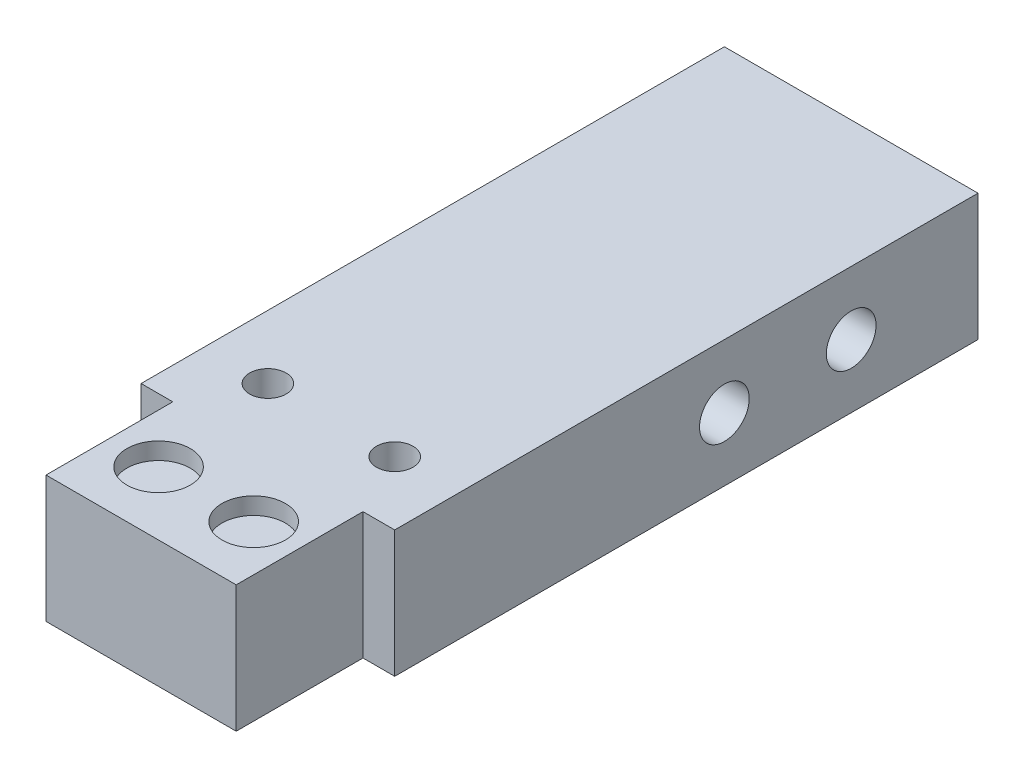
ISO-10303-21;
HEADER;
FILE_DESCRIPTION(('STEP AP214'),'2;1');
FILE_NAME('part.step','',(''),(''),'','','');
FILE_SCHEMA(('AUTOMOTIVE_DESIGN { 1 0 10303 214 1 1 1 1 }'));
ENDSEC;
DATA;
#1=APPLICATION_CONTEXT('core data for automotive mechanical design processes');
#2=APPLICATION_PROTOCOL_DEFINITION('international standard','automotive_design',2000,#1);
#3=PRODUCT_CONTEXT('',#1,'mechanical');
#4=PRODUCT('Part','Part','',(#3));
#5=PRODUCT_RELATED_PRODUCT_CATEGORY('part','',(#4));
#6=PRODUCT_DEFINITION_FORMATION('','',#4);
#7=PRODUCT_DEFINITION_CONTEXT('part definition',#1,'design');
#8=PRODUCT_DEFINITION('design','',#6,#7);
#9=PRODUCT_DEFINITION_SHAPE('','',#8);
#10=(LENGTH_UNIT() NAMED_UNIT(*) SI_UNIT(.MILLI.,.METRE.));
#11=(NAMED_UNIT(*) PLANE_ANGLE_UNIT() SI_UNIT($,.RADIAN.));
#12=(NAMED_UNIT(*) SI_UNIT($,.STERADIAN.) SOLID_ANGLE_UNIT());
#13=UNCERTAINTY_MEASURE_WITH_UNIT(LENGTH_MEASURE(1.E-05),#10,'distance_accuracy_value','');
#14=(GEOMETRIC_REPRESENTATION_CONTEXT(3) GLOBAL_UNCERTAINTY_ASSIGNED_CONTEXT((#13)) GLOBAL_UNIT_ASSIGNED_CONTEXT((#10,
#11,#12)) REPRESENTATION_CONTEXT('',''));
#15=CARTESIAN_POINT('',(0.,0.,0.));
#16=DIRECTION('',(0.,0.,1.));
#17=DIRECTION('',(1.,0.,0.));
#18=AXIS2_PLACEMENT_3D('',#15,#16,#17);
#19=CARTESIAN_POINT('',(12.7,22.86,50.8));
#20=DIRECTION('',(0.,0.,-1.));
#21=DIRECTION('',(-1.,0.,0.));
#22=AXIS2_PLACEMENT_3D('',#19,#20,#21);
#23=PLANE('',#22);
#24=DIRECTION('',(1.,0.,0.));
#25=VECTOR('',#24,1.);
#26=CARTESIAN_POINT('',(-12.7,6.35,50.8));
#27=LINE('',#26,#25);
#28=CARTESIAN_POINT('',(-12.7,6.35,50.8));
#29=VERTEX_POINT('',#28);
#30=CARTESIAN_POINT('',(-9.525,6.35,50.8));
#31=VERTEX_POINT('',#30);
#32=EDGE_CURVE('E169',#29,#31,#27,.T.);
#33=ORIENTED_EDGE('',*,*,#32,.F.);
#34=DIRECTION('',(0.,-1.,0.));
#35=VECTOR('',#34,1.);
#36=CARTESIAN_POINT('',(-12.7,22.86,50.8));
#37=LINE('',#36,#35);
#38=CARTESIAN_POINT('',(-12.7,-6.35000000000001,50.8));
#39=VERTEX_POINT('',#38);
#40=EDGE_CURVE('E92',#29,#39,#37,.T.);
#41=ORIENTED_EDGE('',*,*,#40,.T.);
#42=DIRECTION('',(-1.,0.,0.));
#43=VECTOR('',#42,1.);
#44=CARTESIAN_POINT('',(-12.7,-6.35000000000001,50.8));
#45=LINE('',#44,#43);
#46=CARTESIAN_POINT('',(-9.525,-6.35000000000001,50.8));
#47=VERTEX_POINT('',#46);
#48=EDGE_CURVE('E128',#47,#39,#45,.T.);
#49=ORIENTED_EDGE('',*,*,#48,.F.);
#50=DIRECTION('',(0.,1.,0.));
#51=VECTOR('',#50,1.);
#52=CARTESIAN_POINT('',(-9.525,-6.35000000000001,50.8));
#53=LINE('',#52,#51);
#54=EDGE_CURVE('E126',#47,#31,#53,.T.);
#55=ORIENTED_EDGE('',*,*,#54,.T.);
#56=EDGE_LOOP('',(#33,#41,#49,#55));
#57=FACE_BOUND('',#56,.T.);
#58=ADVANCED_FACE('F33',(#57),#23,.F.);
#59=CARTESIAN_POINT('',(9.525,6.35,50.8));
#60=VERTEX_POINT('',#59);
#61=CARTESIAN_POINT('',(12.7,6.35,50.8));
#62=VERTEX_POINT('',#61);
#63=EDGE_CURVE('E163',#60,#62,#27,.T.);
#64=ORIENTED_EDGE('',*,*,#63,.F.);
#65=DIRECTION('',(0.,1.,0.));
#66=VECTOR('',#65,1.);
#67=CARTESIAN_POINT('',(9.525,-6.35000000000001,50.8));
#68=LINE('',#67,#66);
#69=CARTESIAN_POINT('',(9.525,-6.35000000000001,50.8));
#70=VERTEX_POINT('',#69);
#71=EDGE_CURVE('E174',#70,#60,#68,.T.);
#72=ORIENTED_EDGE('',*,*,#71,.F.);
#73=DIRECTION('',(-1.,0.,0.));
#74=VECTOR('',#73,1.);
#75=CARTESIAN_POINT('',(12.7,-6.35000000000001,50.8));
#76=LINE('',#75,#74);
#77=CARTESIAN_POINT('',(12.7,-6.35,50.8));
#78=VERTEX_POINT('',#77);
#79=EDGE_CURVE('E173',#78,#70,#76,.T.);
#80=ORIENTED_EDGE('',*,*,#79,.F.);
#81=DIRECTION('',(0.,-1.,0.));
#82=VECTOR('',#81,1.);
#83=CARTESIAN_POINT('',(12.7,22.86,50.8));
#84=LINE('',#83,#82);
#85=EDGE_CURVE('E47',#62,#78,#84,.T.);
#86=ORIENTED_EDGE('',*,*,#85,.F.);
#87=EDGE_LOOP('',(#64,#72,#80,#86));
#88=FACE_BOUND('',#87,.T.);
#89=ADVANCED_FACE('F172',(#88),#23,.F.);
#90=CARTESIAN_POINT('',(12.7,0.,0.));
#91=DIRECTION('',(-1.,0.,0.));
#92=DIRECTION('',(0.,0.,1.));
#93=AXIS2_PLACEMENT_3D('',#90,#91,#92);
#94=PLANE('',#93);
#95=CARTESIAN_POINT('',(12.7,0.,5.08));
#96=DIRECTION('',(1.,0.,0.));
#97=DIRECTION('',(0.,0.,-1.));
#98=AXIS2_PLACEMENT_3D('',#95,#96,#97);
#99=CIRCLE('',#98,2.4892);
#100=CARTESIAN_POINT('',(12.7,0.,2.5908));
#101=VERTEX_POINT('',#100);
#102=EDGE_CURVE('E324',#101,#101,#99,.T.);
#103=ORIENTED_EDGE('',*,*,#102,.F.);
#104=EDGE_LOOP('',(#103));
#105=FACE_BOUND('',#104,.T.);
#106=CARTESIAN_POINT('',(12.7,0.,17.78));
#107=DIRECTION('',(1.,0.,0.));
#108=DIRECTION('',(0.,0.,-1.));
#109=AXIS2_PLACEMENT_3D('',#106,#107,#108);
#110=CIRCLE('',#109,2.4892);
#111=CARTESIAN_POINT('',(12.7,0.,15.2908));
#112=VERTEX_POINT('',#111);
#113=EDGE_CURVE('E326',#112,#112,#110,.T.);
#114=ORIENTED_EDGE('',*,*,#113,.F.);
#115=EDGE_LOOP('',(#114));
#116=FACE_BOUND('',#115,.T.);
#117=DIRECTION('',(0.,0.,1.));
#118=VECTOR('',#117,1.);
#119=CARTESIAN_POINT('',(12.7,6.35,-7.62));
#120=LINE('',#119,#118);
#121=CARTESIAN_POINT('',(12.7,6.35,-7.62));
#122=VERTEX_POINT('',#121);
#123=EDGE_CURVE('E87',#122,#62,#120,.T.);
#124=ORIENTED_EDGE('',*,*,#123,.T.);
#125=ORIENTED_EDGE('',*,*,#85,.T.);
#126=DIRECTION('',(0.,0.,-1.));
#127=VECTOR('',#126,1.);
#128=CARTESIAN_POINT('',(12.7,-6.35,63.5));
#129=LINE('',#128,#127);
#130=CARTESIAN_POINT('',(12.7,-6.35,-7.62));
#131=VERTEX_POINT('',#130);
#132=EDGE_CURVE('E94',#78,#131,#129,.T.);
#133=ORIENTED_EDGE('',*,*,#132,.T.);
#134=DIRECTION('',(0.,1.,0.));
#135=VECTOR('',#134,1.);
#136=CARTESIAN_POINT('',(12.7,-6.35,-7.62));
#137=LINE('',#136,#135);
#138=EDGE_CURVE('E53',#131,#122,#137,.T.);
#139=ORIENTED_EDGE('',*,*,#138,.T.);
#140=EDGE_LOOP('',(#124,#125,#133,#139));
#141=FACE_BOUND('',#140,.T.);
#142=ADVANCED_FACE('F168',(#105,#116,#141),#94,.F.);
#143=CARTESIAN_POINT('',(-12.7,0.,0.));
#144=DIRECTION('',(-1.,0.,0.));
#145=DIRECTION('',(0.,0.,1.));
#146=AXIS2_PLACEMENT_3D('',#143,#144,#145);
#147=PLANE('',#146);
#148=CARTESIAN_POINT('',(-12.7,0.,5.08));
#149=DIRECTION('',(1.,0.,0.));
#150=DIRECTION('',(0.,0.,-1.));
#151=AXIS2_PLACEMENT_3D('',#148,#149,#150);
#152=CIRCLE('',#151,2.4892);
#153=CARTESIAN_POINT('',(-12.7,0.,2.5908));
#154=VERTEX_POINT('',#153);
#155=EDGE_CURVE('E322',#154,#154,#152,.T.);
#156=ORIENTED_EDGE('',*,*,#155,.T.);
#157=EDGE_LOOP('',(#156));
#158=FACE_BOUND('',#157,.T.);
#159=CARTESIAN_POINT('',(-12.7,0.,17.78));
#160=DIRECTION('',(1.,0.,0.));
#161=DIRECTION('',(0.,0.,-1.));
#162=AXIS2_PLACEMENT_3D('',#159,#160,#161);
#163=CIRCLE('',#162,2.4892);
#164=CARTESIAN_POINT('',(-12.7,0.,15.2908));
#165=VERTEX_POINT('',#164);
#166=EDGE_CURVE('E329',#165,#165,#163,.T.);
#167=ORIENTED_EDGE('',*,*,#166,.T.);
#168=EDGE_LOOP('',(#167));
#169=FACE_BOUND('',#168,.T.);
#170=ORIENTED_EDGE('',*,*,#40,.F.);
#171=DIRECTION('',(0.,0.,1.));
#172=VECTOR('',#171,1.);
#173=CARTESIAN_POINT('',(-12.7,6.35,-7.62));
#174=LINE('',#173,#172);
#175=CARTESIAN_POINT('',(-12.7,6.35,-7.62));
#176=VERTEX_POINT('',#175);
#177=EDGE_CURVE('E76',#176,#29,#174,.T.);
#178=ORIENTED_EDGE('',*,*,#177,.F.);
#179=DIRECTION('',(0.,1.,0.));
#180=VECTOR('',#179,1.);
#181=CARTESIAN_POINT('',(-12.7,-6.35,-7.62));
#182=LINE('',#181,#180);
#183=CARTESIAN_POINT('',(-12.7,-6.35,-7.62));
#184=VERTEX_POINT('',#183);
#185=EDGE_CURVE('E66',#184,#176,#182,.T.);
#186=ORIENTED_EDGE('',*,*,#185,.F.);
#187=DIRECTION('',(0.,0.,-1.));
#188=VECTOR('',#187,1.);
#189=CARTESIAN_POINT('',(-12.7,-6.35,63.5));
#190=LINE('',#189,#188);
#191=EDGE_CURVE('E77',#39,#184,#190,.T.);
#192=ORIENTED_EDGE('',*,*,#191,.F.);
#193=EDGE_LOOP('',(#170,#178,#186,#192));
#194=FACE_BOUND('',#193,.T.);
#195=ADVANCED_FACE('F90',(#158,#169,#194),#147,.T.);
#196=CARTESIAN_POINT('',(12.7,6.35,63.5));
#197=DIRECTION('',(0.,0.,-1.));
#198=DIRECTION('',(-1.,0.,0.));
#199=AXIS2_PLACEMENT_3D('',#196,#197,#198);
#200=PLANE('',#199);
#201=DIRECTION('',(-1.,0.,0.));
#202=VECTOR('',#201,1.);
#203=CARTESIAN_POINT('',(12.7,-6.35,63.5));
#204=LINE('',#203,#202);
#205=CARTESIAN_POINT('',(9.525,-6.35000000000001,63.5));
#206=VERTEX_POINT('',#205);
#207=CARTESIAN_POINT('',(-9.525,-6.35000000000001,63.5));
#208=VERTEX_POINT('',#207);
#209=EDGE_CURVE('E40',#206,#208,#204,.T.);
#210=ORIENTED_EDGE('',*,*,#209,.F.);
#211=DIRECTION('',(0.,1.,0.));
#212=VECTOR('',#211,1.);
#213=CARTESIAN_POINT('',(9.525,-6.35000000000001,63.5));
#214=LINE('',#213,#212);
#215=CARTESIAN_POINT('',(9.525,6.34999999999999,63.5));
#216=VERTEX_POINT('',#215);
#217=EDGE_CURVE('E150',#206,#216,#214,.T.);
#218=ORIENTED_EDGE('',*,*,#217,.T.);
#219=DIRECTION('',(-1.,0.,0.));
#220=VECTOR('',#219,1.);
#221=CARTESIAN_POINT('',(12.7,6.35,63.5));
#222=LINE('',#221,#220);
#223=CARTESIAN_POINT('',(-9.525,6.34999999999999,63.5));
#224=VERTEX_POINT('',#223);
#225=EDGE_CURVE('E11',#216,#224,#222,.T.);
#226=ORIENTED_EDGE('',*,*,#225,.T.);
#227=DIRECTION('',(0.,1.,0.));
#228=VECTOR('',#227,1.);
#229=CARTESIAN_POINT('',(-9.525,-6.35000000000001,63.5));
#230=LINE('',#229,#228);
#231=EDGE_CURVE('E123',#208,#224,#230,.T.);
#232=ORIENTED_EDGE('',*,*,#231,.F.);
#233=EDGE_LOOP('',(#210,#218,#226,#232));
#234=FACE_BOUND('',#233,.T.);
#235=ADVANCED_FACE('F131',(#234),#200,.F.);
#236=CARTESIAN_POINT('',(12.7,-6.35,63.5));
#237=DIRECTION('',(0.,1.,0.));
#238=DIRECTION('',(0.,0.,1.));
#239=AXIS2_PLACEMENT_3D('',#236,#237,#238);
#240=PLANE('',#239);
#241=CARTESIAN_POINT('',(6.35,-6.35,44.45));
#242=DIRECTION('',(0.,1.,0.));
#243=DIRECTION('',(0.,0.,1.));
#244=AXIS2_PLACEMENT_3D('',#241,#242,#243);
#245=CIRCLE('',#244,1.8288);
#246=CARTESIAN_POINT('',(6.35,-6.35,46.2788));
#247=VERTEX_POINT('',#246);
#248=EDGE_CURVE('E337',#247,#247,#245,.T.);
#249=ORIENTED_EDGE('',*,*,#248,.T.);
#250=EDGE_LOOP('',(#249));
#251=FACE_BOUND('',#250,.T.);
#252=CARTESIAN_POINT('',(-6.35,-6.35,44.45));
#253=DIRECTION('',(0.,1.,0.));
#254=DIRECTION('',(0.,0.,1.));
#255=AXIS2_PLACEMENT_3D('',#252,#253,#254);
#256=CIRCLE('',#255,1.8288);
#257=CARTESIAN_POINT('',(-6.35,-6.35,46.2788));
#258=VERTEX_POINT('',#257);
#259=EDGE_CURVE('E170',#258,#258,#256,.T.);
#260=ORIENTED_EDGE('',*,*,#259,.T.);
#261=EDGE_LOOP('',(#260));
#262=FACE_BOUND('',#261,.T.);
#263=ORIENTED_EDGE('',*,*,#79,.T.);
#264=DIRECTION('',(0.,0.,1.));
#265=VECTOR('',#264,1.);
#266=CARTESIAN_POINT('',(9.525,-6.35000000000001,50.8));
#267=LINE('',#266,#265);
#268=EDGE_CURVE('E112',#70,#206,#267,.T.);
#269=ORIENTED_EDGE('',*,*,#268,.T.);
#270=ORIENTED_EDGE('',*,*,#209,.T.);
#271=DIRECTION('',(0.,0.,-1.));
#272=VECTOR('',#271,1.);
#273=CARTESIAN_POINT('',(-9.525,-6.35000000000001,50.8));
#274=LINE('',#273,#272);
#275=EDGE_CURVE('E109',#208,#47,#274,.T.);
#276=ORIENTED_EDGE('',*,*,#275,.T.);
#277=ORIENTED_EDGE('',*,*,#48,.T.);
#278=ORIENTED_EDGE('',*,*,#191,.T.);
#279=DIRECTION('',(-1.,0.,0.));
#280=VECTOR('',#279,1.);
#281=CARTESIAN_POINT('',(12.7,-6.35,-7.62));
#282=LINE('',#281,#280);
#283=EDGE_CURVE('E72',#131,#184,#282,.T.);
#284=ORIENTED_EDGE('',*,*,#283,.F.);
#285=ORIENTED_EDGE('',*,*,#132,.F.);
#286=EDGE_LOOP('',(#263,#269,#270,#276,#277,#278,#284,#285));
#287=FACE_BOUND('',#286,.T.);
#288=ADVANCED_FACE('F106',(#251,#262,#287),#240,.F.);
#289=CARTESIAN_POINT('',(12.7,-6.35,-7.62));
#290=DIRECTION('',(0.,0.,1.));
#291=DIRECTION('',(1.,0.,0.));
#292=AXIS2_PLACEMENT_3D('',#289,#290,#291);
#293=PLANE('',#292);
#294=ORIENTED_EDGE('',*,*,#185,.T.);
#295=DIRECTION('',(-1.,0.,0.));
#296=VECTOR('',#295,1.);
#297=CARTESIAN_POINT('',(12.7,6.35,-7.62));
#298=LINE('',#297,#296);
#299=EDGE_CURVE('E69',#122,#176,#298,.T.);
#300=ORIENTED_EDGE('',*,*,#299,.F.);
#301=ORIENTED_EDGE('',*,*,#138,.F.);
#302=ORIENTED_EDGE('',*,*,#283,.T.);
#303=EDGE_LOOP('',(#294,#300,#301,#302));
#304=FACE_BOUND('',#303,.T.);
#305=ADVANCED_FACE('F68',(#304),#293,.F.);
#306=CARTESIAN_POINT('',(12.7,6.35,-7.62));
#307=DIRECTION('',(0.,-1.,0.));
#308=DIRECTION('',(0.,0.,-1.));
#309=AXIS2_PLACEMENT_3D('',#306,#307,#308);
#310=PLANE('',#309);
#311=CARTESIAN_POINT('',(6.35,6.35,44.45));
#312=DIRECTION('',(0.,1.,0.));
#313=DIRECTION('',(0.,0.,1.));
#314=AXIS2_PLACEMENT_3D('',#311,#312,#313);
#315=CIRCLE('',#314,1.8288);
#316=CARTESIAN_POINT('',(6.35,6.35,46.2788));
#317=VERTEX_POINT('',#316);
#318=EDGE_CURVE('E332',#317,#317,#315,.T.);
#319=ORIENTED_EDGE('',*,*,#318,.F.);
#320=EDGE_LOOP('',(#319));
#321=FACE_BOUND('',#320,.T.);
#322=CARTESIAN_POINT('',(-6.35,6.35,44.45));
#323=DIRECTION('',(0.,1.,0.));
#324=DIRECTION('',(0.,0.,1.));
#325=AXIS2_PLACEMENT_3D('',#322,#323,#324);
#326=CIRCLE('',#325,1.8288);
#327=CARTESIAN_POINT('',(-6.35,6.35,46.2788));
#328=VERTEX_POINT('',#327);
#329=EDGE_CURVE('E340',#328,#328,#326,.T.);
#330=ORIENTED_EDGE('',*,*,#329,.F.);
#331=EDGE_LOOP('',(#330));
#332=FACE_BOUND('',#331,.T.);
#333=ORIENTED_EDGE('',*,*,#177,.T.);
#334=ORIENTED_EDGE('',*,*,#32,.T.);
#335=DIRECTION('',(0.,0.,-1.));
#336=VECTOR('',#335,1.);
#337=CARTESIAN_POINT('',(-9.525,6.34999999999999,50.8));
#338=LINE('',#337,#336);
#339=EDGE_CURVE('E129',#224,#31,#338,.T.);
#340=ORIENTED_EDGE('',*,*,#339,.F.);
#341=ORIENTED_EDGE('',*,*,#225,.F.);
#342=DIRECTION('',(0.,0.,1.));
#343=VECTOR('',#342,1.);
#344=CARTESIAN_POINT('',(9.525,6.34999999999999,50.8));
#345=LINE('',#344,#343);
#346=EDGE_CURVE('E159',#60,#216,#345,.T.);
#347=ORIENTED_EDGE('',*,*,#346,.F.);
#348=ORIENTED_EDGE('',*,*,#63,.T.);
#349=ORIENTED_EDGE('',*,*,#123,.F.);
#350=ORIENTED_EDGE('',*,*,#299,.T.);
#351=EDGE_LOOP('',(#333,#334,#340,#341,#347,#348,#349,#350));
#352=FACE_BOUND('',#351,.T.);
#353=CARTESIAN_POINT('',(4.92547683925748,6.35,57.15));
#354=DIRECTION('',(0.,1.,0.));
#355=DIRECTION('',(0.,0.,1.));
#356=AXIS2_PLACEMENT_3D('',#353,#354,#355);
#357=CIRCLE('',#356,3.175);
#358=CARTESIAN_POINT('',(4.92547683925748,6.35,60.325));
#359=VERTEX_POINT('',#358);
#360=EDGE_CURVE('E184',#359,#359,#357,.T.);
#361=ORIENTED_EDGE('',*,*,#360,.F.);
#362=EDGE_LOOP('',(#361));
#363=FACE_BOUND('',#362,.T.);
#364=CARTESIAN_POINT('',(-4.59952316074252,6.35,57.15));
#365=DIRECTION('',(0.,1.,0.));
#366=DIRECTION('',(0.,0.,1.));
#367=AXIS2_PLACEMENT_3D('',#364,#365,#366);
#368=CIRCLE('',#367,3.175);
#369=CARTESIAN_POINT('',(-4.59952316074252,6.35,60.325));
#370=VERTEX_POINT('',#369);
#371=EDGE_CURVE('E180',#370,#370,#368,.T.);
#372=ORIENTED_EDGE('',*,*,#371,.F.);
#373=EDGE_LOOP('',(#372));
#374=FACE_BOUND('',#373,.T.);
#375=ADVANCED_FACE('F81',(#321,#332,#352,#363,#374),#310,.F.);
#376=CARTESIAN_POINT('',(-9.525,-6.35000000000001,50.8));
#377=DIRECTION('',(1.,0.,0.));
#378=DIRECTION('',(0.,0.,-1.));
#379=AXIS2_PLACEMENT_3D('',#376,#377,#378);
#380=PLANE('',#379);
#381=ORIENTED_EDGE('',*,*,#339,.T.);
#382=ORIENTED_EDGE('',*,*,#54,.F.);
#383=ORIENTED_EDGE('',*,*,#275,.F.);
#384=ORIENTED_EDGE('',*,*,#231,.T.);
#385=EDGE_LOOP('',(#381,#382,#383,#384));
#386=FACE_BOUND('',#385,.T.);
#387=ADVANCED_FACE('F122',(#386),#380,.F.);
#388=CARTESIAN_POINT('',(9.525,-6.35000000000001,50.8));
#389=DIRECTION('',(-1.,0.,0.));
#390=DIRECTION('',(0.,0.,1.));
#391=AXIS2_PLACEMENT_3D('',#388,#389,#390);
#392=PLANE('',#391);
#393=ORIENTED_EDGE('',*,*,#346,.T.);
#394=ORIENTED_EDGE('',*,*,#217,.F.);
#395=ORIENTED_EDGE('',*,*,#268,.F.);
#396=ORIENTED_EDGE('',*,*,#71,.T.);
#397=EDGE_LOOP('',(#393,#394,#395,#396));
#398=FACE_BOUND('',#397,.T.);
#399=ADVANCED_FACE('F245',(#398),#392,.F.);
#400=CARTESIAN_POINT('',(-4.59952316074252,4.6482,57.15));
#401=DIRECTION('',(0.,1.,0.));
#402=DIRECTION('',(0.,0.,1.));
#403=AXIS2_PLACEMENT_3D('',#400,#401,#402);
#404=CYLINDRICAL_SURFACE('',#403,3.175);
#405=CARTESIAN_POINT('',(-4.59952316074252,4.6482,57.15));
#406=DIRECTION('',(0.,1.,0.));
#407=DIRECTION('',(0.,0.,1.));
#408=AXIS2_PLACEMENT_3D('',#405,#406,#407);
#409=CIRCLE('',#408,3.175);
#410=CARTESIAN_POINT('',(-4.59952316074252,4.6482,60.325));
#411=VERTEX_POINT('',#410);
#412=EDGE_CURVE('E177',#411,#411,#409,.T.);
#413=ORIENTED_EDGE('',*,*,#412,.F.);
#414=EDGE_LOOP('',(#413));
#415=FACE_BOUND('',#414,.T.);
#416=ORIENTED_EDGE('',*,*,#371,.T.);
#417=EDGE_LOOP('',(#416));
#418=FACE_BOUND('',#417,.T.);
#419=ADVANCED_FACE('F250',(#415,#418),#404,.F.);
#420=CARTESIAN_POINT('',(-4.59952316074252,4.6482,57.15));
#421=DIRECTION('',(0.,1.,0.));
#422=DIRECTION('',(0.,0.,1.));
#423=AXIS2_PLACEMENT_3D('',#420,#421,#422);
#424=PLANE('',#423);
#425=ORIENTED_EDGE('',*,*,#412,.T.);
#426=EDGE_LOOP('',(#425));
#427=FACE_BOUND('',#426,.T.);
#428=ADVANCED_FACE('F255',(#427),#424,.T.);
#429=CARTESIAN_POINT('',(4.92547683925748,4.6482,57.15));
#430=DIRECTION('',(0.,1.,0.));
#431=DIRECTION('',(0.,0.,1.));
#432=AXIS2_PLACEMENT_3D('',#429,#430,#431);
#433=CYLINDRICAL_SURFACE('',#432,3.175);
#434=CARTESIAN_POINT('',(4.92547683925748,4.6482,57.15));
#435=DIRECTION('',(0.,1.,0.));
#436=DIRECTION('',(0.,0.,1.));
#437=AXIS2_PLACEMENT_3D('',#434,#435,#436);
#438=CIRCLE('',#437,3.175);
#439=CARTESIAN_POINT('',(4.92547683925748,4.6482,60.325));
#440=VERTEX_POINT('',#439);
#441=EDGE_CURVE('E345',#440,#440,#438,.T.);
#442=ORIENTED_EDGE('',*,*,#441,.F.);
#443=EDGE_LOOP('',(#442));
#444=FACE_BOUND('',#443,.T.);
#445=ORIENTED_EDGE('',*,*,#360,.T.);
#446=EDGE_LOOP('',(#445));
#447=FACE_BOUND('',#446,.T.);
#448=ADVANCED_FACE('F263',(#444,#447),#433,.F.);
#449=CARTESIAN_POINT('',(4.92547683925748,4.6482,57.15));
#450=DIRECTION('',(0.,1.,0.));
#451=DIRECTION('',(0.,0.,1.));
#452=AXIS2_PLACEMENT_3D('',#449,#450,#451);
#453=PLANE('',#452);
#454=ORIENTED_EDGE('',*,*,#441,.T.);
#455=EDGE_LOOP('',(#454));
#456=FACE_BOUND('',#455,.T.);
#457=ADVANCED_FACE('F271',(#456),#453,.T.);
#458=CARTESIAN_POINT('',(-6.35,-11.43,44.45));
#459=DIRECTION('',(0.,1.,0.));
#460=DIRECTION('',(0.,0.,1.));
#461=AXIS2_PLACEMENT_3D('',#458,#459,#460);
#462=CYLINDRICAL_SURFACE('',#461,1.8288);
#463=ORIENTED_EDGE('',*,*,#329,.T.);
#464=EDGE_LOOP('',(#463));
#465=FACE_BOUND('',#464,.T.);
#466=ORIENTED_EDGE('',*,*,#259,.F.);
#467=EDGE_LOOP('',(#466));
#468=FACE_BOUND('',#467,.T.);
#469=ADVANCED_FACE('F279',(#465,#468),#462,.F.);
#470=CARTESIAN_POINT('',(6.35,-11.43,44.45));
#471=DIRECTION('',(0.,1.,0.));
#472=DIRECTION('',(0.,0.,1.));
#473=AXIS2_PLACEMENT_3D('',#470,#471,#472);
#474=CYLINDRICAL_SURFACE('',#473,1.8288);
#475=ORIENTED_EDGE('',*,*,#318,.T.);
#476=EDGE_LOOP('',(#475));
#477=FACE_BOUND('',#476,.T.);
#478=ORIENTED_EDGE('',*,*,#248,.F.);
#479=EDGE_LOOP('',(#478));
#480=FACE_BOUND('',#479,.T.);
#481=ADVANCED_FACE('F286',(#477,#480),#474,.F.);
#482=CARTESIAN_POINT('',(-12.7,0.,17.78));
#483=DIRECTION('',(1.,0.,0.));
#484=DIRECTION('',(0.,0.,-1.));
#485=AXIS2_PLACEMENT_3D('',#482,#483,#484);
#486=CYLINDRICAL_SURFACE('',#485,2.4892);
#487=ORIENTED_EDGE('',*,*,#166,.F.);
#488=EDGE_LOOP('',(#487));
#489=FACE_BOUND('',#488,.T.);
#490=ORIENTED_EDGE('',*,*,#113,.T.);
#491=EDGE_LOOP('',(#490));
#492=FACE_BOUND('',#491,.T.);
#493=ADVANCED_FACE('F292',(#489,#492),#486,.F.);
#494=CARTESIAN_POINT('',(-12.7,0.,5.08));
#495=DIRECTION('',(1.,0.,0.));
#496=DIRECTION('',(0.,0.,-1.));
#497=AXIS2_PLACEMENT_3D('',#494,#495,#496);
#498=CYLINDRICAL_SURFACE('',#497,2.4892);
#499=ORIENTED_EDGE('',*,*,#155,.F.);
#500=EDGE_LOOP('',(#499));
#501=FACE_BOUND('',#500,.T.);
#502=ORIENTED_EDGE('',*,*,#102,.T.);
#503=EDGE_LOOP('',(#502));
#504=FACE_BOUND('',#503,.T.);
#505=ADVANCED_FACE('F300',(#501,#504),#498,.F.);
#506=CLOSED_SHELL('',(#58,#89,#142,#195,#235,#288,#305,#375,#387,#399,#419,#428,#448,#457,#469,
#481,#493,#505));
#507=MANIFOLD_SOLID_BREP('B2',#506);
#508=ADVANCED_BREP_SHAPE_REPRESENTATION('',(#18,#507),#14);
#509=SHAPE_DEFINITION_REPRESENTATION(#9,#508);
ENDSEC;
END-ISO-10303-21;
